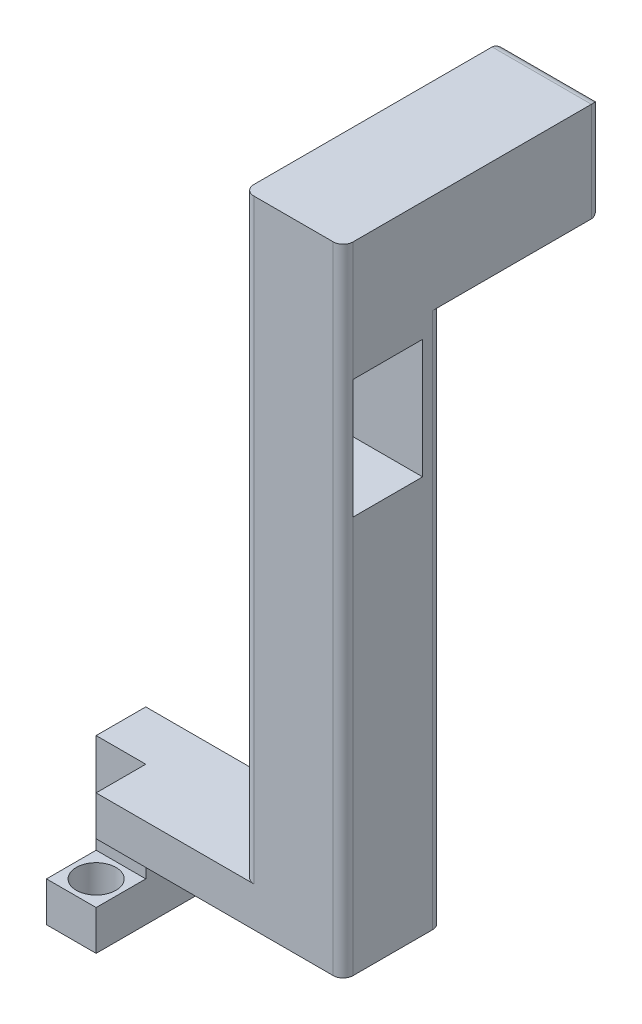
from build123d import *

# Parameters (mm, degrees)
SKETCH1_W           = 14.94
SKETCH1_H           = 5
BOSS_EXTRUDE1_DEPTH = 2
SKETCH5_W           = 5
SKETCH5_H           = 5
BOSS_EXTRUDE3_DEPTH = 30
SKETCH6_W           = 5
SKETCH6_H           = 5
BOSS_EXTRUDE4_DEPTH = 8
FILLET1_R           = 0.5
SKETCH7_W           = 3.5
SKETCH7_H           = 6
CUT_EXTRUDE3_DEPTH  = 8
SKETCH8_W           = 2.5
SKETCH8_H           = 5
BOSS_EXTRUDE5_DEPTH = 5
SKETCH9_W           = 2.5
SKETCH9_H           = 5
CUT_EXTRUDE4_DEPTH  = 2.5
CUT_EXTRUDE5_DEPTH  = 2.5


with BuildPart() as part:
    # Sketch1 → Boss-Extrude1 (new body)
    with BuildSketch(Plane(origin=(0, 0, 0), x_dir=(1, 0, 0), z_dir=(0, 1, 0))):
        Rectangle(SKETCH1_W, SKETCH1_H)
    extrude(amount=BOSS_EXTRUDE1_DEPTH)

    # Sketch5 → Boss-Extrude3 (add)
    with BuildSketch(Plane(origin=(0, 2, 0), x_dir=(1, 0, 0), z_dir=(0, 1, 0))):
        with Locations((4.97, 0)):
            Rectangle(SKETCH5_W, SKETCH5_H)
    extrude(amount=BOSS_EXTRUDE3_DEPTH)

    # Sketch6 → Boss-Extrude4 (add)
    with BuildSketch(Plane(origin=(0, 0, -2.5), x_dir=(-1, 0, 0), z_dir=(0, 0, -1))):
        with Locations((-4.97, 29.5)):
            Rectangle(SKETCH6_W, SKETCH6_H)
    extrude(amount=BOSS_EXTRUDE4_DEPTH)

    # Fillet1
    fillet1_edges = [part.edges().sort_by_distance(p)[0] for p in [
        (2.47, 17, 2.5),
        (2.47, 14.5, -2.5),
        (7.47, 13.5, -2.5),
        (7.47, 29.5, -10.5),
        (4.97, 27, -10.5),
        (2.47, 29.5, -10.5),
        (4.97, 32, -10.5),
        (7.47, 16, 2.5),
    ]]
    fillet(fillet1_edges, radius=FILLET1_R)

    # Sketch7 → Cut-Extrude3 (cut)
    with BuildSketch(Plane.ZY.offset(-2.47)):
        with Locations((0.25, 23)):
            Rectangle(SKETCH7_W, SKETCH7_H)
    extrude(amount=-CUT_EXTRUDE3_DEPTH, mode=Mode.SUBTRACT)

    # Sketch8 → Boss-Extrude5 (add)
    with BuildSketch(Plane.XZ):
        with Locations((-6.22, 0)):
            Rectangle(SKETCH8_W, SKETCH8_H)
    extrude(amount=BOSS_EXTRUDE5_DEPTH)

    # Sketch9 → Cut-Extrude4 (cut)
    with BuildSketch(Plane.ZY.offset(7.47)):
        with Locations((1.25, -0.5)):
            Rectangle(SKETCH9_W, SKETCH9_H)
    extrude(amount=-CUT_EXTRUDE4_DEPTH, mode=Mode.SUBTRACT)

    # Sketch10 → Cut-Extrude5 (cut)
    with BuildSketch(Plane(origin=(0, -3, 0), x_dir=(1, 0, 0), z_dir=(0, 1, 0))):
        with BuildLine():
            ThreePointArc((-7.22, -1.25), (-6.22, -2.25), (-5.22, -1.25))
            Line((-5.22, -1.25), (-7.22, -1.25))
        make_face()
        with BuildLine():
            Line((-7.22, -1.25), (-5.22, -1.25))
            ThreePointArc((-5.22, -1.25), (-6.22, -0.25), (-7.22, -1.25))
        make_face()
        with BuildLine():
            ThreePointArc((-7.22, -1.25), (-6.22, -2.25), (-5.22, -1.25))
            Line((-5.22, -1.25), (-7.22, -1.25))
        make_face()
        with BuildLine():
            Line((-7.22, -1.25), (-5.22, -1.25))
            ThreePointArc((-5.22, -1.25), (-6.22, -0.25), (-7.22, -1.25))
        make_face()
    extrude(amount=-CUT_EXTRUDE5_DEPTH, mode=Mode.SUBTRACT)


solid = part.part
